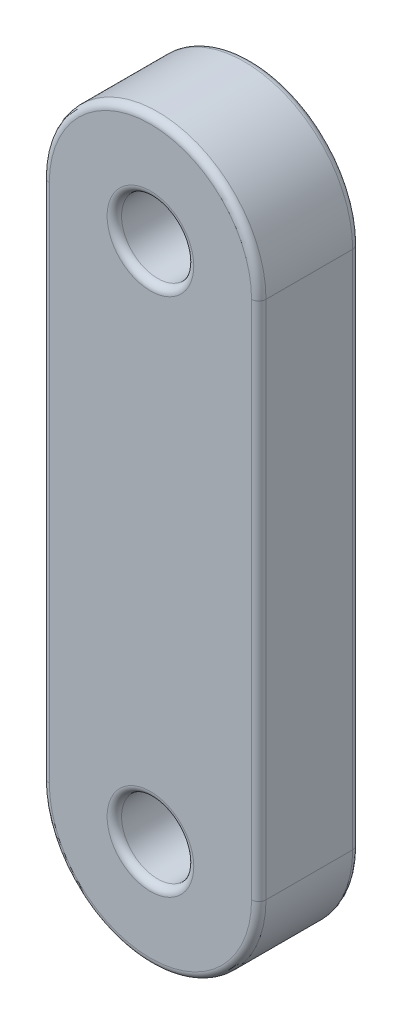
ISO-10303-21;
HEADER;
FILE_DESCRIPTION(('STEP AP214'),'2;1');
FILE_NAME('part.step','',(''),(''),'','','');
FILE_SCHEMA(('AUTOMOTIVE_DESIGN { 1 0 10303 214 1 1 1 1 }'));
ENDSEC;
DATA;
#1=APPLICATION_CONTEXT('core data for automotive mechanical design processes');
#2=APPLICATION_PROTOCOL_DEFINITION('international standard','automotive_design',2000,#1);
#3=PRODUCT_CONTEXT('',#1,'mechanical');
#4=PRODUCT('Part','Part','',(#3));
#5=PRODUCT_RELATED_PRODUCT_CATEGORY('part','',(#4));
#6=PRODUCT_DEFINITION_FORMATION('','',#4);
#7=PRODUCT_DEFINITION_CONTEXT('part definition',#1,'design');
#8=PRODUCT_DEFINITION('design','',#6,#7);
#9=PRODUCT_DEFINITION_SHAPE('','',#8);
#10=(LENGTH_UNIT() NAMED_UNIT(*) SI_UNIT(.MILLI.,.METRE.));
#11=(NAMED_UNIT(*) PLANE_ANGLE_UNIT() SI_UNIT($,.RADIAN.));
#12=(NAMED_UNIT(*) SI_UNIT($,.STERADIAN.) SOLID_ANGLE_UNIT());
#13=UNCERTAINTY_MEASURE_WITH_UNIT(LENGTH_MEASURE(1.E-05),#10,'distance_accuracy_value','');
#14=(GEOMETRIC_REPRESENTATION_CONTEXT(3) GLOBAL_UNCERTAINTY_ASSIGNED_CONTEXT((#13)) GLOBAL_UNIT_ASSIGNED_CONTEXT((#10,
#11,#12)) REPRESENTATION_CONTEXT('',''));
#15=CARTESIAN_POINT('',(0.,0.,0.));
#16=DIRECTION('',(0.,0.,1.));
#17=DIRECTION('',(1.,0.,0.));
#18=AXIS2_PLACEMENT_3D('',#15,#16,#17);
#19=CARTESIAN_POINT('',(0.,18.0025,3.5));
#20=DIRECTION('',(0.,0.,1.));
#21=DIRECTION('',(1.,0.,0.));
#22=AXIS2_PLACEMENT_3D('',#19,#20,#21);
#23=PLANE('',#22);
#24=CARTESIAN_POINT('',(0.,-18.0025,3.5));
#25=DIRECTION('',(0.,0.,1.));
#26=DIRECTION('',(1.,0.,0.));
#27=AXIS2_PLACEMENT_3D('',#24,#25,#26);
#28=CIRCLE('',#27,3.);
#29=CARTESIAN_POINT('',(3.,-18.0025,3.5));
#30=VERTEX_POINT('',#29);
#31=EDGE_CURVE('E11',#30,#30,#28,.F.);
#32=ORIENTED_EDGE('',*,*,#31,.T.);
#33=EDGE_LOOP('',(#32));
#34=FACE_BOUND('',#33,.T.);
#35=CARTESIAN_POINT('',(0.,-18.0025,3.5));
#36=DIRECTION('',(0.,0.,1.));
#37=DIRECTION('',(1.,0.,0.));
#38=AXIS2_PLACEMENT_3D('',#35,#36,#37);
#39=CIRCLE('',#38,7.);
#40=CARTESIAN_POINT('',(-7.,-18.0025,3.5));
#41=VERTEX_POINT('',#40);
#42=CARTESIAN_POINT('',(7.,-18.0025,3.5));
#43=VERTEX_POINT('',#42);
#44=EDGE_CURVE('E47',#41,#43,#39,.T.);
#45=ORIENTED_EDGE('',*,*,#44,.T.);
#46=DIRECTION('',(0.,1.,0.));
#47=VECTOR('',#46,1.);
#48=CARTESIAN_POINT('',(7.,18.0025,3.5));
#49=LINE('',#48,#47);
#50=CARTESIAN_POINT('',(7.,18.0025,3.5));
#51=VERTEX_POINT('',#50);
#52=EDGE_CURVE('E39',#43,#51,#49,.T.);
#53=ORIENTED_EDGE('',*,*,#52,.T.);
#54=CARTESIAN_POINT('',(0.,18.0025,3.5));
#55=DIRECTION('',(0.,0.,1.));
#56=DIRECTION('',(1.,0.,0.));
#57=AXIS2_PLACEMENT_3D('',#54,#55,#56);
#58=CIRCLE('',#57,7.);
#59=CARTESIAN_POINT('',(-7.,18.0025,3.5));
#60=VERTEX_POINT('',#59);
#61=EDGE_CURVE('E163',#51,#60,#58,.T.);
#62=ORIENTED_EDGE('',*,*,#61,.T.);
#63=DIRECTION('',(0.,-1.,0.));
#64=VECTOR('',#63,1.);
#65=CARTESIAN_POINT('',(-7.,-18.0025,3.5));
#66=LINE('',#65,#64);
#67=EDGE_CURVE('E52',#60,#41,#66,.T.);
#68=ORIENTED_EDGE('',*,*,#67,.T.);
#69=EDGE_LOOP('',(#45,#53,#62,#68));
#70=FACE_BOUND('',#69,.T.);
#71=CARTESIAN_POINT('',(0.,18.0025,3.5));
#72=DIRECTION('',(0.,0.,1.));
#73=DIRECTION('',(1.,0.,0.));
#74=AXIS2_PLACEMENT_3D('',#71,#72,#73);
#75=CIRCLE('',#74,3.);
#76=CARTESIAN_POINT('',(3.,18.0025,3.5));
#77=VERTEX_POINT('',#76);
#78=EDGE_CURVE('E160',#77,#77,#75,.F.);
#79=ORIENTED_EDGE('',*,*,#78,.T.);
#80=EDGE_LOOP('',(#79));
#81=FACE_BOUND('',#80,.T.);
#82=ADVANCED_FACE('F30',(#34,#70,#81),#23,.T.);
#83=CARTESIAN_POINT('',(0.,18.0025,-3.5));
#84=DIRECTION('',(0.,0.,1.));
#85=DIRECTION('',(1.,0.,0.));
#86=AXIS2_PLACEMENT_3D('',#83,#84,#85);
#87=PLANE('',#86);
#88=CARTESIAN_POINT('',(0.,-18.0025,-3.5));
#89=DIRECTION('',(0.,0.,1.));
#90=DIRECTION('',(1.,0.,0.));
#91=AXIS2_PLACEMENT_3D('',#88,#89,#90);
#92=CIRCLE('',#91,3.);
#93=CARTESIAN_POINT('',(3.,-18.0025,-3.5));
#94=VERTEX_POINT('',#93);
#95=EDGE_CURVE('E125',#94,#94,#92,.T.);
#96=ORIENTED_EDGE('',*,*,#95,.T.);
#97=EDGE_LOOP('',(#96));
#98=FACE_BOUND('',#97,.T.);
#99=CARTESIAN_POINT('',(0.,-18.0025,-3.5));
#100=DIRECTION('',(0.,0.,1.));
#101=DIRECTION('',(1.,0.,0.));
#102=AXIS2_PLACEMENT_3D('',#99,#100,#101);
#103=CIRCLE('',#102,7.);
#104=CARTESIAN_POINT('',(7.,-18.0025,-3.5));
#105=VERTEX_POINT('',#104);
#106=CARTESIAN_POINT('',(-6.99999999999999,-18.0025,-3.5));
#107=VERTEX_POINT('',#106);
#108=EDGE_CURVE('E124',#105,#107,#103,.F.);
#109=ORIENTED_EDGE('',*,*,#108,.T.);
#110=DIRECTION('',(0.,-1.,0.));
#111=VECTOR('',#110,1.);
#112=CARTESIAN_POINT('',(-7.,18.0025,-3.5));
#113=LINE('',#112,#111);
#114=CARTESIAN_POINT('',(-7.,18.0025,-3.5));
#115=VERTEX_POINT('',#114);
#116=EDGE_CURVE('E102',#107,#115,#113,.F.);
#117=ORIENTED_EDGE('',*,*,#116,.T.);
#118=CARTESIAN_POINT('',(0.,18.0025,-3.5));
#119=DIRECTION('',(0.,0.,1.));
#120=DIRECTION('',(1.,0.,0.));
#121=AXIS2_PLACEMENT_3D('',#118,#119,#120);
#122=CIRCLE('',#121,7.);
#123=CARTESIAN_POINT('',(7.,18.0025,-3.5));
#124=VERTEX_POINT('',#123);
#125=EDGE_CURVE('E112',#115,#124,#122,.F.);
#126=ORIENTED_EDGE('',*,*,#125,.T.);
#127=DIRECTION('',(0.,1.,0.));
#128=VECTOR('',#127,1.);
#129=CARTESIAN_POINT('',(7.,18.0025,-3.5));
#130=LINE('',#129,#128);
#131=EDGE_CURVE('E118',#124,#105,#130,.F.);
#132=ORIENTED_EDGE('',*,*,#131,.T.);
#133=EDGE_LOOP('',(#109,#117,#126,#132));
#134=FACE_BOUND('',#133,.T.);
#135=CARTESIAN_POINT('',(0.,18.0025,-3.5));
#136=DIRECTION('',(0.,0.,1.));
#137=DIRECTION('',(1.,0.,0.));
#138=AXIS2_PLACEMENT_3D('',#135,#136,#137);
#139=CIRCLE('',#138,3.);
#140=CARTESIAN_POINT('',(3.,18.0025,-3.5));
#141=VERTEX_POINT('',#140);
#142=EDGE_CURVE('E119',#141,#141,#139,.T.);
#143=ORIENTED_EDGE('',*,*,#142,.T.);
#144=EDGE_LOOP('',(#143));
#145=FACE_BOUND('',#144,.T.);
#146=ADVANCED_FACE('F121',(#98,#134,#145),#87,.F.);
#147=CARTESIAN_POINT('',(0.,18.0025,3.5));
#148=DIRECTION('',(0.,0.,-1.));
#149=DIRECTION('',(-1.,0.,0.));
#150=AXIS2_PLACEMENT_3D('',#147,#148,#149);
#151=CYLINDRICAL_SURFACE('',#150,7.5);
#152=DIRECTION('',(0.,0.,-1.));
#153=VECTOR('',#152,1.);
#154=CARTESIAN_POINT('',(7.5,18.0025,3.5));
#155=LINE('',#154,#153);
#156=CARTESIAN_POINT('',(7.5,18.0025,3.));
#157=VERTEX_POINT('',#156);
#158=CARTESIAN_POINT('',(7.5,18.0025,-3.));
#159=VERTEX_POINT('',#158);
#160=EDGE_CURVE('E172',#157,#159,#155,.T.);
#161=ORIENTED_EDGE('',*,*,#160,.T.);
#162=CARTESIAN_POINT('',(0.,18.0025,-3.));
#163=DIRECTION('',(0.,0.,1.));
#164=DIRECTION('',(1.,0.,0.));
#165=AXIS2_PLACEMENT_3D('',#162,#163,#164);
#166=CIRCLE('',#165,7.5);
#167=CARTESIAN_POINT('',(-7.5,18.0025,-3.));
#168=VERTEX_POINT('',#167);
#169=EDGE_CURVE('E152',#159,#168,#166,.T.);
#170=ORIENTED_EDGE('',*,*,#169,.T.);
#171=DIRECTION('',(0.,0.,-1.));
#172=VECTOR('',#171,1.);
#173=CARTESIAN_POINT('',(-7.5,18.0025,3.5));
#174=LINE('',#173,#172);
#175=CARTESIAN_POINT('',(-7.5,18.0025,3.));
#176=VERTEX_POINT('',#175);
#177=EDGE_CURVE('E194',#176,#168,#174,.T.);
#178=ORIENTED_EDGE('',*,*,#177,.F.);
#179=CARTESIAN_POINT('',(0.,18.0025,3.));
#180=DIRECTION('',(0.,0.,1.));
#181=DIRECTION('',(1.,0.,0.));
#182=AXIS2_PLACEMENT_3D('',#179,#180,#181);
#183=CIRCLE('',#182,7.5);
#184=EDGE_CURVE('E150',#176,#157,#183,.F.);
#185=ORIENTED_EDGE('',*,*,#184,.T.);
#186=EDGE_LOOP('',(#161,#170,#178,#185));
#187=FACE_BOUND('',#186,.T.);
#188=ADVANCED_FACE('F199',(#187),#151,.T.);
#189=CARTESIAN_POINT('',(-7.5,18.0025,3.5));
#190=DIRECTION('',(1.,0.,0.));
#191=DIRECTION('',(0.,1.,0.));
#192=AXIS2_PLACEMENT_3D('',#189,#190,#191);
#193=PLANE('',#192);
#194=ORIENTED_EDGE('',*,*,#177,.T.);
#195=DIRECTION('',(0.,-1.,0.));
#196=VECTOR('',#195,1.);
#197=CARTESIAN_POINT('',(-7.5,18.0025,-3.));
#198=LINE('',#197,#196);
#199=CARTESIAN_POINT('',(-7.5,-18.0025,-3.));
#200=VERTEX_POINT('',#199);
#201=EDGE_CURVE('E105',#168,#200,#198,.T.);
#202=ORIENTED_EDGE('',*,*,#201,.T.);
#203=DIRECTION('',(0.,0.,-1.));
#204=VECTOR('',#203,1.);
#205=CARTESIAN_POINT('',(-7.5,-18.0025,3.5));
#206=LINE('',#205,#204);
#207=CARTESIAN_POINT('',(-7.5,-18.0025,3.));
#208=VERTEX_POINT('',#207);
#209=EDGE_CURVE('E196',#208,#200,#206,.T.);
#210=ORIENTED_EDGE('',*,*,#209,.F.);
#211=DIRECTION('',(0.,-1.,0.));
#212=VECTOR('',#211,1.);
#213=CARTESIAN_POINT('',(-7.5,18.0025,3.));
#214=LINE('',#213,#212);
#215=EDGE_CURVE('E138',#208,#176,#214,.F.);
#216=ORIENTED_EDGE('',*,*,#215,.T.);
#217=EDGE_LOOP('',(#194,#202,#210,#216));
#218=FACE_BOUND('',#217,.T.);
#219=ADVANCED_FACE('F193',(#218),#193,.F.);
#220=CARTESIAN_POINT('',(0.,-18.0025,3.5));
#221=DIRECTION('',(0.,0.,-1.));
#222=DIRECTION('',(-1.,0.,0.));
#223=AXIS2_PLACEMENT_3D('',#220,#221,#222);
#224=CYLINDRICAL_SURFACE('',#223,7.5);
#225=ORIENTED_EDGE('',*,*,#209,.T.);
#226=CARTESIAN_POINT('',(0.,-18.0025,-3.));
#227=DIRECTION('',(0.,0.,1.));
#228=DIRECTION('',(1.,0.,0.));
#229=AXIS2_PLACEMENT_3D('',#226,#227,#228);
#230=CIRCLE('',#229,7.5);
#231=CARTESIAN_POINT('',(7.5,-18.0025,-3.));
#232=VERTEX_POINT('',#231);
#233=EDGE_CURVE('E143',#200,#232,#230,.T.);
#234=ORIENTED_EDGE('',*,*,#233,.T.);
#235=DIRECTION('',(0.,0.,-1.));
#236=VECTOR('',#235,1.);
#237=CARTESIAN_POINT('',(7.5,-18.0025,3.5));
#238=LINE('',#237,#236);
#239=CARTESIAN_POINT('',(7.5,-18.0025,3.));
#240=VERTEX_POINT('',#239);
#241=EDGE_CURVE('E204',#240,#232,#238,.T.);
#242=ORIENTED_EDGE('',*,*,#241,.F.);
#243=CARTESIAN_POINT('',(0.,-18.0025,3.));
#244=DIRECTION('',(0.,0.,1.));
#245=DIRECTION('',(1.,0.,0.));
#246=AXIS2_PLACEMENT_3D('',#243,#244,#245);
#247=CIRCLE('',#246,7.5);
#248=EDGE_CURVE('E141',#240,#208,#247,.F.);
#249=ORIENTED_EDGE('',*,*,#248,.T.);
#250=EDGE_LOOP('',(#225,#234,#242,#249));
#251=FACE_BOUND('',#250,.T.);
#252=ADVANCED_FACE('F217',(#251),#224,.T.);
#253=CARTESIAN_POINT('',(7.5,18.0025,3.5));
#254=DIRECTION('',(-1.,0.,0.));
#255=DIRECTION('',(0.,-1.,0.));
#256=AXIS2_PLACEMENT_3D('',#253,#254,#255);
#257=PLANE('',#256);
#258=ORIENTED_EDGE('',*,*,#241,.T.);
#259=DIRECTION('',(0.,1.,0.));
#260=VECTOR('',#259,1.);
#261=CARTESIAN_POINT('',(7.5,18.0025,-3.));
#262=LINE('',#261,#260);
#263=EDGE_CURVE('E148',#232,#159,#262,.T.);
#264=ORIENTED_EDGE('',*,*,#263,.T.);
#265=ORIENTED_EDGE('',*,*,#160,.F.);
#266=DIRECTION('',(0.,1.,0.));
#267=VECTOR('',#266,1.);
#268=CARTESIAN_POINT('',(7.5,-18.0025,3.));
#269=LINE('',#268,#267);
#270=EDGE_CURVE('E145',#157,#240,#269,.F.);
#271=ORIENTED_EDGE('',*,*,#270,.T.);
#272=EDGE_LOOP('',(#258,#264,#265,#271));
#273=FACE_BOUND('',#272,.T.);
#274=ADVANCED_FACE('F221',(#273),#257,.F.);
#275=CARTESIAN_POINT('',(0.,18.0025,3.5));
#276=DIRECTION('',(0.,0.,-1.));
#277=DIRECTION('',(-1.,0.,0.));
#278=AXIS2_PLACEMENT_3D('',#275,#276,#277);
#279=CYLINDRICAL_SURFACE('',#278,2.5);
#280=CARTESIAN_POINT('',(0.,18.0025,-3.));
#281=DIRECTION('',(0.,0.,1.));
#282=DIRECTION('',(1.,0.,0.));
#283=AXIS2_PLACEMENT_3D('',#280,#281,#282);
#284=CIRCLE('',#283,2.5);
#285=CARTESIAN_POINT('',(2.5,18.0025,-3.));
#286=VERTEX_POINT('',#285);
#287=EDGE_CURVE('E157',#286,#286,#284,.F.);
#288=ORIENTED_EDGE('',*,*,#287,.T.);
#289=EDGE_LOOP('',(#288));
#290=FACE_BOUND('',#289,.T.);
#291=CARTESIAN_POINT('',(0.,18.0025,3.));
#292=DIRECTION('',(0.,0.,1.));
#293=DIRECTION('',(1.,0.,0.));
#294=AXIS2_PLACEMENT_3D('',#291,#292,#293);
#295=CIRCLE('',#294,2.5);
#296=CARTESIAN_POINT('',(2.5,18.0025,3.));
#297=VERTEX_POINT('',#296);
#298=EDGE_CURVE('E154',#297,#297,#295,.T.);
#299=ORIENTED_EDGE('',*,*,#298,.T.);
#300=EDGE_LOOP('',(#299));
#301=FACE_BOUND('',#300,.T.);
#302=ADVANCED_FACE('F237',(#290,#301),#279,.F.);
#303=CARTESIAN_POINT('',(0.,-18.0025,3.5));
#304=DIRECTION('',(0.,0.,-1.));
#305=DIRECTION('',(-1.,0.,0.));
#306=AXIS2_PLACEMENT_3D('',#303,#304,#305);
#307=CYLINDRICAL_SURFACE('',#306,2.5);
#308=CARTESIAN_POINT('',(0.,-18.0025,-3.));
#309=DIRECTION('',(0.,0.,1.));
#310=DIRECTION('',(1.,0.,0.));
#311=AXIS2_PLACEMENT_3D('',#308,#309,#310);
#312=CIRCLE('',#311,2.5);
#313=CARTESIAN_POINT('',(2.5,-18.0025,-3.));
#314=VERTEX_POINT('',#313);
#315=EDGE_CURVE('E135',#314,#314,#312,.F.);
#316=ORIENTED_EDGE('',*,*,#315,.T.);
#317=EDGE_LOOP('',(#316));
#318=FACE_BOUND('',#317,.T.);
#319=CARTESIAN_POINT('',(0.,-18.0025,3.));
#320=DIRECTION('',(0.,0.,1.));
#321=DIRECTION('',(1.,0.,0.));
#322=AXIS2_PLACEMENT_3D('',#319,#320,#321);
#323=CIRCLE('',#322,2.5);
#324=CARTESIAN_POINT('',(2.5,-18.0025,3.));
#325=VERTEX_POINT('',#324);
#326=EDGE_CURVE('E128',#325,#325,#323,.T.);
#327=ORIENTED_EDGE('',*,*,#326,.T.);
#328=EDGE_LOOP('',(#327));
#329=FACE_BOUND('',#328,.T.);
#330=ADVANCED_FACE('F239',(#318,#329),#307,.F.);
#331=CARTESIAN_POINT('',(0.,-18.0025,-3.));
#332=DIRECTION('',(0.,0.,1.));
#333=DIRECTION('',(1.,0.,0.));
#334=AXIS2_PLACEMENT_3D('',#331,#332,#333);
#335=TOROIDAL_SURFACE('',#334,3.,0.5);
#336=ORIENTED_EDGE('',*,*,#315,.F.);
#337=EDGE_LOOP('',(#336));
#338=FACE_BOUND('',#337,.T.);
#339=ORIENTED_EDGE('',*,*,#95,.F.);
#340=EDGE_LOOP('',(#339));
#341=FACE_BOUND('',#340,.T.);
#342=ADVANCED_FACE('F246',(#338,#341),#335,.T.);
#343=CARTESIAN_POINT('',(7.,18.0025,-3.));
#344=DIRECTION('',(0.,1.,0.));
#345=DIRECTION('',(-1.,0.,0.));
#346=AXIS2_PLACEMENT_3D('',#343,#344,#345);
#347=CYLINDRICAL_SURFACE('',#346,0.5);
#348=CARTESIAN_POINT('',(7.,-18.0025,-3.));
#349=DIRECTION('',(0.,-1.,0.));
#350=DIRECTION('',(0.,0.,-1.));
#351=AXIS2_PLACEMENT_3D('',#348,#349,#350);
#352=CIRCLE('',#351,0.5);
#353=EDGE_CURVE('E108',#105,#232,#352,.T.);
#354=ORIENTED_EDGE('',*,*,#353,.F.);
#355=ORIENTED_EDGE('',*,*,#131,.F.);
#356=CARTESIAN_POINT('',(7.,18.0025,-3.));
#357=DIRECTION('',(0.,1.,0.));
#358=DIRECTION('',(0.,0.,1.));
#359=AXIS2_PLACEMENT_3D('',#356,#357,#358);
#360=CIRCLE('',#359,0.5);
#361=EDGE_CURVE('E115',#159,#124,#360,.T.);
#362=ORIENTED_EDGE('',*,*,#361,.F.);
#363=ORIENTED_EDGE('',*,*,#263,.F.);
#364=EDGE_LOOP('',(#354,#355,#362,#363));
#365=FACE_BOUND('',#364,.T.);
#366=ADVANCED_FACE('F210',(#365),#347,.T.);
#367=CARTESIAN_POINT('',(0.,18.0025,-3.));
#368=DIRECTION('',(0.,0.,1.));
#369=DIRECTION('',(1.,0.,0.));
#370=AXIS2_PLACEMENT_3D('',#367,#368,#369);
#371=TOROIDAL_SURFACE('',#370,7.,0.5);
#372=ORIENTED_EDGE('',*,*,#361,.T.);
#373=ORIENTED_EDGE('',*,*,#125,.F.);
#374=CARTESIAN_POINT('',(-7.,18.0025,-3.));
#375=DIRECTION('',(0.,-1.,0.));
#376=DIRECTION('',(0.,0.,-1.));
#377=AXIS2_PLACEMENT_3D('',#374,#375,#376);
#378=CIRCLE('',#377,0.5);
#379=EDGE_CURVE('E98',#168,#115,#378,.T.);
#380=ORIENTED_EDGE('',*,*,#379,.F.);
#381=ORIENTED_EDGE('',*,*,#169,.F.);
#382=EDGE_LOOP('',(#372,#373,#380,#381));
#383=FACE_BOUND('',#382,.T.);
#384=ADVANCED_FACE('F113',(#383),#371,.T.);
#385=CARTESIAN_POINT('',(0.,-18.0025,-3.));
#386=DIRECTION('',(0.,0.,1.));
#387=DIRECTION('',(1.,0.,0.));
#388=AXIS2_PLACEMENT_3D('',#385,#386,#387);
#389=TOROIDAL_SURFACE('',#388,7.,0.5);
#390=ORIENTED_EDGE('',*,*,#353,.T.);
#391=ORIENTED_EDGE('',*,*,#233,.F.);
#392=CARTESIAN_POINT('',(-6.99999999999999,-18.0025,-3.));
#393=DIRECTION('',(0.,1.,0.));
#394=DIRECTION('',(0.,0.,1.));
#395=AXIS2_PLACEMENT_3D('',#392,#393,#394);
#396=CIRCLE('',#395,0.5);
#397=EDGE_CURVE('E109',#107,#200,#396,.T.);
#398=ORIENTED_EDGE('',*,*,#397,.F.);
#399=ORIENTED_EDGE('',*,*,#108,.F.);
#400=EDGE_LOOP('',(#390,#391,#398,#399));
#401=FACE_BOUND('',#400,.T.);
#402=ADVANCED_FACE('F213',(#401),#389,.T.);
#403=CARTESIAN_POINT('',(-7.,18.0025,-3.));
#404=DIRECTION('',(0.,-1.,0.));
#405=DIRECTION('',(1.,0.,0.));
#406=AXIS2_PLACEMENT_3D('',#403,#404,#405);
#407=CYLINDRICAL_SURFACE('',#406,0.5);
#408=ORIENTED_EDGE('',*,*,#379,.T.);
#409=ORIENTED_EDGE('',*,*,#116,.F.);
#410=ORIENTED_EDGE('',*,*,#397,.T.);
#411=ORIENTED_EDGE('',*,*,#201,.F.);
#412=EDGE_LOOP('',(#408,#409,#410,#411));
#413=FACE_BOUND('',#412,.T.);
#414=ADVANCED_FACE('F100',(#413),#407,.T.);
#415=CARTESIAN_POINT('',(0.,18.0025,-3.));
#416=DIRECTION('',(0.,0.,1.));
#417=DIRECTION('',(1.,0.,0.));
#418=AXIS2_PLACEMENT_3D('',#415,#416,#417);
#419=TOROIDAL_SURFACE('',#418,3.,0.5);
#420=ORIENTED_EDGE('',*,*,#287,.F.);
#421=EDGE_LOOP('',(#420));
#422=FACE_BOUND('',#421,.T.);
#423=ORIENTED_EDGE('',*,*,#142,.F.);
#424=EDGE_LOOP('',(#423));
#425=FACE_BOUND('',#424,.T.);
#426=ADVANCED_FACE('F265',(#422,#425),#419,.T.);
#427=CARTESIAN_POINT('',(0.,-18.0025,3.));
#428=DIRECTION('',(0.,0.,1.));
#429=DIRECTION('',(1.,0.,0.));
#430=AXIS2_PLACEMENT_3D('',#427,#428,#429);
#431=TOROIDAL_SURFACE('',#430,3.,0.5);
#432=ORIENTED_EDGE('',*,*,#31,.F.);
#433=EDGE_LOOP('',(#432));
#434=FACE_BOUND('',#433,.T.);
#435=ORIENTED_EDGE('',*,*,#326,.F.);
#436=EDGE_LOOP('',(#435));
#437=FACE_BOUND('',#436,.T.);
#438=ADVANCED_FACE('F274',(#434,#437),#431,.T.);
#439=CARTESIAN_POINT('',(-7.,18.0025,3.));
#440=DIRECTION('',(0.,1.,0.));
#441=DIRECTION('',(-1.,0.,0.));
#442=AXIS2_PLACEMENT_3D('',#439,#440,#441);
#443=CYLINDRICAL_SURFACE('',#442,0.5);
#444=CARTESIAN_POINT('',(-7.,18.0025,3.));
#445=DIRECTION('',(0.,1.,0.));
#446=DIRECTION('',(0.,0.,1.));
#447=AXIS2_PLACEMENT_3D('',#444,#445,#446);
#448=CIRCLE('',#447,0.5);
#449=EDGE_CURVE('E176',#176,#60,#448,.T.);
#450=ORIENTED_EDGE('',*,*,#449,.F.);
#451=ORIENTED_EDGE('',*,*,#215,.F.);
#452=CARTESIAN_POINT('',(-7.,-18.0025,3.));
#453=DIRECTION('',(0.,-1.,0.));
#454=DIRECTION('',(0.,0.,-1.));
#455=AXIS2_PLACEMENT_3D('',#452,#453,#454);
#456=CIRCLE('',#455,0.5);
#457=EDGE_CURVE('E34',#41,#208,#456,.T.);
#458=ORIENTED_EDGE('',*,*,#457,.F.);
#459=ORIENTED_EDGE('',*,*,#67,.F.);
#460=EDGE_LOOP('',(#450,#451,#458,#459));
#461=FACE_BOUND('',#460,.T.);
#462=ADVANCED_FACE('F188',(#461),#443,.T.);
#463=CARTESIAN_POINT('',(0.,-18.0025,3.));
#464=DIRECTION('',(0.,0.,1.));
#465=DIRECTION('',(1.,0.,0.));
#466=AXIS2_PLACEMENT_3D('',#463,#464,#465);
#467=TOROIDAL_SURFACE('',#466,7.,0.5);
#468=ORIENTED_EDGE('',*,*,#457,.T.);
#469=ORIENTED_EDGE('',*,*,#248,.F.);
#470=CARTESIAN_POINT('',(7.,-18.0025,3.));
#471=DIRECTION('',(0.,1.,0.));
#472=DIRECTION('',(0.,0.,1.));
#473=AXIS2_PLACEMENT_3D('',#470,#471,#472);
#474=CIRCLE('',#473,0.5);
#475=EDGE_CURVE('E175',#43,#240,#474,.T.);
#476=ORIENTED_EDGE('',*,*,#475,.F.);
#477=ORIENTED_EDGE('',*,*,#44,.F.);
#478=EDGE_LOOP('',(#468,#469,#476,#477));
#479=FACE_BOUND('',#478,.T.);
#480=ADVANCED_FACE('F185',(#479),#467,.T.);
#481=CARTESIAN_POINT('',(0.,18.0025,3.));
#482=DIRECTION('',(0.,0.,1.));
#483=DIRECTION('',(1.,0.,0.));
#484=AXIS2_PLACEMENT_3D('',#481,#482,#483);
#485=TOROIDAL_SURFACE('',#484,7.,0.5);
#486=ORIENTED_EDGE('',*,*,#449,.T.);
#487=ORIENTED_EDGE('',*,*,#61,.F.);
#488=CARTESIAN_POINT('',(7.,18.0025,3.));
#489=DIRECTION('',(0.,-1.,0.));
#490=DIRECTION('',(0.,0.,-1.));
#491=AXIS2_PLACEMENT_3D('',#488,#489,#490);
#492=CIRCLE('',#491,0.5);
#493=EDGE_CURVE('E173',#157,#51,#492,.T.);
#494=ORIENTED_EDGE('',*,*,#493,.F.);
#495=ORIENTED_EDGE('',*,*,#184,.F.);
#496=EDGE_LOOP('',(#486,#487,#494,#495));
#497=FACE_BOUND('',#496,.T.);
#498=ADVANCED_FACE('F226',(#497),#485,.T.);
#499=CARTESIAN_POINT('',(7.,18.0025,3.));
#500=DIRECTION('',(0.,-1.,0.));
#501=DIRECTION('',(1.,0.,0.));
#502=AXIS2_PLACEMENT_3D('',#499,#500,#501);
#503=CYLINDRICAL_SURFACE('',#502,0.5);
#504=ORIENTED_EDGE('',*,*,#475,.T.);
#505=ORIENTED_EDGE('',*,*,#270,.F.);
#506=ORIENTED_EDGE('',*,*,#493,.T.);
#507=ORIENTED_EDGE('',*,*,#52,.F.);
#508=EDGE_LOOP('',(#504,#505,#506,#507));
#509=FACE_BOUND('',#508,.T.);
#510=ADVANCED_FACE('F224',(#509),#503,.T.);
#511=CARTESIAN_POINT('',(0.,18.0025,3.));
#512=DIRECTION('',(0.,0.,1.));
#513=DIRECTION('',(1.,0.,0.));
#514=AXIS2_PLACEMENT_3D('',#511,#512,#513);
#515=TOROIDAL_SURFACE('',#514,3.,0.5);
#516=ORIENTED_EDGE('',*,*,#78,.F.);
#517=EDGE_LOOP('',(#516));
#518=FACE_BOUND('',#517,.T.);
#519=ORIENTED_EDGE('',*,*,#298,.F.);
#520=EDGE_LOOP('',(#519));
#521=FACE_BOUND('',#520,.T.);
#522=ADVANCED_FACE('F32',(#518,#521),#515,.T.);
#523=CLOSED_SHELL('',(#82,#146,#188,#219,#252,#274,#302,#330,#342,#366,#384,#402,#414,#426,#438,
#462,#480,#498,#510,#522));
#524=MANIFOLD_SOLID_BREP('B2',#523);
#525=ADVANCED_BREP_SHAPE_REPRESENTATION('',(#18,#524),#14);
#526=SHAPE_DEFINITION_REPRESENTATION(#9,#525);
ENDSEC;
END-ISO-10303-21;
